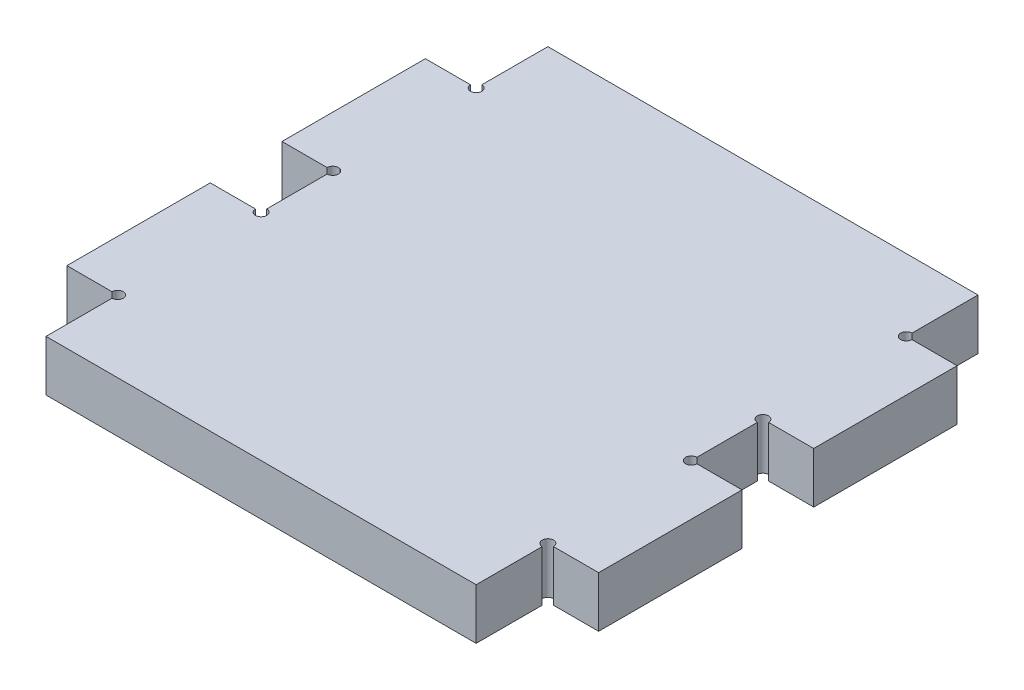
ISO-10303-21;
HEADER;
FILE_DESCRIPTION(('STEP AP214'),'2;1');
FILE_NAME('part.step','',(''),(''),'','','');
FILE_SCHEMA(('AUTOMOTIVE_DESIGN { 1 0 10303 214 1 1 1 1 }'));
ENDSEC;
DATA;
#1=APPLICATION_CONTEXT('core data for automotive mechanical design processes');
#2=APPLICATION_PROTOCOL_DEFINITION('international standard','automotive_design',2000,#1);
#3=PRODUCT_CONTEXT('',#1,'mechanical');
#4=PRODUCT('Part','Part','',(#3));
#5=PRODUCT_RELATED_PRODUCT_CATEGORY('part','',(#4));
#6=PRODUCT_DEFINITION_FORMATION('','',#4);
#7=PRODUCT_DEFINITION_CONTEXT('part definition',#1,'design');
#8=PRODUCT_DEFINITION('design','',#6,#7);
#9=PRODUCT_DEFINITION_SHAPE('','',#8);
#10=(LENGTH_UNIT() NAMED_UNIT(*) SI_UNIT(.MILLI.,.METRE.));
#11=(NAMED_UNIT(*) PLANE_ANGLE_UNIT() SI_UNIT($,.RADIAN.));
#12=(NAMED_UNIT(*) SI_UNIT($,.STERADIAN.) SOLID_ANGLE_UNIT());
#13=UNCERTAINTY_MEASURE_WITH_UNIT(LENGTH_MEASURE(1.E-05),#10,'distance_accuracy_value','');
#14=(GEOMETRIC_REPRESENTATION_CONTEXT(3) GLOBAL_UNCERTAINTY_ASSIGNED_CONTEXT((#13)) GLOBAL_UNIT_ASSIGNED_CONTEXT((#10,
#11,#12)) REPRESENTATION_CONTEXT('',''));
#15=CARTESIAN_POINT('',(0.,0.,0.));
#16=DIRECTION('',(0.,0.,1.));
#17=DIRECTION('',(1.,0.,0.));
#18=AXIS2_PLACEMENT_3D('',#15,#16,#17);
#19=CARTESIAN_POINT('',(0.,4.5,-6.35));
#20=DIRECTION('',(0.,0.,1.));
#21=DIRECTION('',(1.,0.,0.));
#22=AXIS2_PLACEMENT_3D('',#19,#20,#21);
#23=PLANE('',#22);
#24=DIRECTION('',(-1.,0.,0.));
#25=VECTOR('',#24,1.);
#26=CARTESIAN_POINT('',(0.,0.,-6.35));
#27=LINE('',#26,#25);
#28=CARTESIAN_POINT('',(-0.500000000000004,0.,-6.35));
#29=VERTEX_POINT('',#28);
#30=CARTESIAN_POINT('',(-4.5,0.,-6.35));
#31=VERTEX_POINT('',#30);
#32=EDGE_CURVE('E252',#29,#31,#27,.T.);
#33=ORIENTED_EDGE('',*,*,#32,.F.);
#34=DIRECTION('',(0.,-1.,0.));
#35=VECTOR('',#34,1.);
#36=CARTESIAN_POINT('',(-0.500000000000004,4.5,-6.35));
#37=LINE('',#36,#35);
#38=CARTESIAN_POINT('',(-0.500000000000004,4.5,-6.35));
#39=VERTEX_POINT('',#38);
#40=EDGE_CURVE('E11',#39,#29,#37,.T.);
#41=ORIENTED_EDGE('',*,*,#40,.F.);
#42=DIRECTION('',(-1.,0.,0.));
#43=VECTOR('',#42,1.);
#44=CARTESIAN_POINT('',(0.,4.5,-6.35));
#45=LINE('',#44,#43);
#46=CARTESIAN_POINT('',(-4.5,4.5,-6.35));
#47=VERTEX_POINT('',#46);
#48=EDGE_CURVE('E319',#39,#47,#45,.T.);
#49=ORIENTED_EDGE('',*,*,#48,.T.);
#50=DIRECTION('',(0.,-1.,0.));
#51=VECTOR('',#50,1.);
#52=CARTESIAN_POINT('',(-4.5,4.5,-6.35));
#53=LINE('',#52,#51);
#54=EDGE_CURVE('E145',#47,#31,#53,.T.);
#55=ORIENTED_EDGE('',*,*,#54,.T.);
#56=EDGE_LOOP('',(#33,#41,#49,#55));
#57=FACE_BOUND('',#56,.T.);
#58=ADVANCED_FACE('F35',(#57),#23,.T.);
#59=CARTESIAN_POINT('',(0.,4.5,-6.35));
#60=DIRECTION('',(0.,-1.,0.));
#61=DIRECTION('',(0.,0.,-1.));
#62=AXIS2_PLACEMENT_3D('',#59,#60,#61);
#63=CYLINDRICAL_SURFACE('',#62,0.500000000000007);
#64=CARTESIAN_POINT('',(0.,0.,-6.35));
#65=DIRECTION('',(0.,1.,0.));
#66=DIRECTION('',(0.,0.,1.));
#67=AXIS2_PLACEMENT_3D('',#64,#65,#66);
#68=CIRCLE('',#67,0.500000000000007);
#69=CARTESIAN_POINT('',(0.,0.,-5.84999999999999));
#70=VERTEX_POINT('',#69);
#71=EDGE_CURVE('E255',#29,#70,#68,.F.);
#72=ORIENTED_EDGE('',*,*,#71,.T.);
#73=DIRECTION('',(0.,-1.,0.));
#74=VECTOR('',#73,1.);
#75=CARTESIAN_POINT('',(0.,4.5,-5.84999999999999));
#76=LINE('',#75,#74);
#77=CARTESIAN_POINT('',(0.,4.5,-5.84999999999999));
#78=VERTEX_POINT('',#77);
#79=EDGE_CURVE('E43',#78,#70,#76,.T.);
#80=ORIENTED_EDGE('',*,*,#79,.F.);
#81=CARTESIAN_POINT('',(0.,4.5,-6.35));
#82=DIRECTION('',(0.,1.,0.));
#83=DIRECTION('',(0.,0.,1.));
#84=AXIS2_PLACEMENT_3D('',#81,#82,#83);
#85=CIRCLE('',#84,0.500000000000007);
#86=EDGE_CURVE('E455',#39,#78,#85,.F.);
#87=ORIENTED_EDGE('',*,*,#86,.F.);
#88=ORIENTED_EDGE('',*,*,#40,.T.);
#89=EDGE_LOOP('',(#72,#80,#87,#88));
#90=FACE_BOUND('',#89,.T.);
#91=ADVANCED_FACE('F378',(#90),#63,.F.);
#92=CARTESIAN_POINT('',(0.,4.5,0.));
#93=DIRECTION('',(-1.,0.,0.));
#94=DIRECTION('',(0.,0.,1.));
#95=AXIS2_PLACEMENT_3D('',#92,#93,#94);
#96=PLANE('',#95);
#97=DIRECTION('',(0.,0.,-1.));
#98=VECTOR('',#97,1.);
#99=CARTESIAN_POINT('',(0.,0.,0.));
#100=LINE('',#99,#98);
#101=CARTESIAN_POINT('',(0.,0.,0.));
#102=VERTEX_POINT('',#101);
#103=EDGE_CURVE('E258',#102,#70,#100,.T.);
#104=ORIENTED_EDGE('',*,*,#103,.F.);
#105=DIRECTION('',(0.,-1.,0.));
#106=VECTOR('',#105,1.);
#107=CARTESIAN_POINT('',(0.,4.5,0.));
#108=LINE('',#107,#106);
#109=CARTESIAN_POINT('',(0.,4.5,0.));
#110=VERTEX_POINT('',#109);
#111=EDGE_CURVE('E369',#110,#102,#108,.T.);
#112=ORIENTED_EDGE('',*,*,#111,.F.);
#113=DIRECTION('',(0.,0.,-1.));
#114=VECTOR('',#113,1.);
#115=CARTESIAN_POINT('',(0.,4.5,0.));
#116=LINE('',#115,#114);
#117=EDGE_CURVE('E247',#110,#78,#116,.T.);
#118=ORIENTED_EDGE('',*,*,#117,.T.);
#119=ORIENTED_EDGE('',*,*,#79,.T.);
#120=EDGE_LOOP('',(#104,#112,#118,#119));
#121=FACE_BOUND('',#120,.T.);
#122=ADVANCED_FACE('F374',(#121),#96,.T.);
#123=CARTESIAN_POINT('',(0.,4.5,0.));
#124=DIRECTION('',(0.,0.,-1.));
#125=DIRECTION('',(-1.,0.,0.));
#126=AXIS2_PLACEMENT_3D('',#123,#124,#125);
#127=PLANE('',#126);
#128=DIRECTION('',(1.,0.,0.));
#129=VECTOR('',#128,1.);
#130=CARTESIAN_POINT('',(0.,0.,0.));
#131=LINE('',#130,#129);
#132=CARTESIAN_POINT('',(38.1,0.,0.));
#133=VERTEX_POINT('',#132);
#134=EDGE_CURVE('E261',#102,#133,#131,.T.);
#135=ORIENTED_EDGE('',*,*,#134,.T.);
#136=DIRECTION('',(0.,-1.,0.));
#137=VECTOR('',#136,1.);
#138=CARTESIAN_POINT('',(38.1,4.5,0.));
#139=LINE('',#138,#137);
#140=CARTESIAN_POINT('',(38.1,4.5,0.));
#141=VERTEX_POINT('',#140);
#142=EDGE_CURVE('E366',#141,#133,#139,.T.);
#143=ORIENTED_EDGE('',*,*,#142,.F.);
#144=DIRECTION('',(1.,0.,0.));
#145=VECTOR('',#144,1.);
#146=CARTESIAN_POINT('',(0.,4.5,0.));
#147=LINE('',#146,#145);
#148=EDGE_CURVE('E395',#110,#141,#147,.T.);
#149=ORIENTED_EDGE('',*,*,#148,.F.);
#150=ORIENTED_EDGE('',*,*,#111,.T.);
#151=EDGE_LOOP('',(#135,#143,#149,#150));
#152=FACE_BOUND('',#151,.T.);
#153=ADVANCED_FACE('F385',(#152),#127,.F.);
#154=CARTESIAN_POINT('',(38.1,4.5,0.));
#155=DIRECTION('',(-1.,0.,0.));
#156=DIRECTION('',(0.,0.,1.));
#157=AXIS2_PLACEMENT_3D('',#154,#155,#156);
#158=PLANE('',#157);
#159=DIRECTION('',(0.,0.,-1.));
#160=VECTOR('',#159,1.);
#161=CARTESIAN_POINT('',(38.1,0.,0.));
#162=LINE('',#161,#160);
#163=CARTESIAN_POINT('',(38.1,0.,-5.85));
#164=VERTEX_POINT('',#163);
#165=EDGE_CURVE('E265',#133,#164,#162,.T.);
#166=ORIENTED_EDGE('',*,*,#165,.T.);
#167=DIRECTION('',(0.,-1.,0.));
#168=VECTOR('',#167,1.);
#169=CARTESIAN_POINT('',(38.1,4.5,-5.85));
#170=LINE('',#169,#168);
#171=CARTESIAN_POINT('',(38.1,4.5,-5.85));
#172=VERTEX_POINT('',#171);
#173=EDGE_CURVE('E364',#172,#164,#170,.T.);
#174=ORIENTED_EDGE('',*,*,#173,.F.);
#175=DIRECTION('',(0.,0.,-1.));
#176=VECTOR('',#175,1.);
#177=CARTESIAN_POINT('',(38.1,4.5,0.));
#178=LINE('',#177,#176);
#179=EDGE_CURVE('E391',#141,#172,#178,.T.);
#180=ORIENTED_EDGE('',*,*,#179,.F.);
#181=ORIENTED_EDGE('',*,*,#142,.T.);
#182=EDGE_LOOP('',(#166,#174,#180,#181));
#183=FACE_BOUND('',#182,.T.);
#184=ADVANCED_FACE('F389',(#183),#158,.F.);
#185=CARTESIAN_POINT('',(38.1,4.5,-6.35));
#186=DIRECTION('',(0.,-1.,0.));
#187=DIRECTION('',(0.,0.,-1.));
#188=AXIS2_PLACEMENT_3D('',#185,#186,#187);
#189=CYLINDRICAL_SURFACE('',#188,0.500000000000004);
#190=CARTESIAN_POINT('',(38.1,0.,-6.35));
#191=DIRECTION('',(0.,1.,0.));
#192=DIRECTION('',(0.,0.,1.));
#193=AXIS2_PLACEMENT_3D('',#190,#191,#192);
#194=CIRCLE('',#193,0.500000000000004);
#195=CARTESIAN_POINT('',(38.6,0.,-6.35));
#196=VERTEX_POINT('',#195);
#197=EDGE_CURVE('E268',#196,#164,#194,.T.);
#198=ORIENTED_EDGE('',*,*,#197,.F.);
#199=DIRECTION('',(0.,-1.,0.));
#200=VECTOR('',#199,1.);
#201=CARTESIAN_POINT('',(38.6,4.5,-6.35));
#202=LINE('',#201,#200);
#203=CARTESIAN_POINT('',(38.6,4.5,-6.35));
#204=VERTEX_POINT('',#203);
#205=EDGE_CURVE('E362',#204,#196,#202,.T.);
#206=ORIENTED_EDGE('',*,*,#205,.F.);
#207=CARTESIAN_POINT('',(38.1,4.5,-6.35));
#208=DIRECTION('',(0.,1.,0.));
#209=DIRECTION('',(0.,0.,1.));
#210=AXIS2_PLACEMENT_3D('',#207,#208,#209);
#211=CIRCLE('',#210,0.500000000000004);
#212=EDGE_CURVE('E394',#204,#172,#211,.T.);
#213=ORIENTED_EDGE('',*,*,#212,.T.);
#214=ORIENTED_EDGE('',*,*,#173,.T.);
#215=EDGE_LOOP('',(#198,#206,#213,#214));
#216=FACE_BOUND('',#215,.T.);
#217=ADVANCED_FACE('F534',(#216),#189,.F.);
#218=CARTESIAN_POINT('',(0.,4.5,-6.34999999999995));
#219=DIRECTION('',(0.,0.,-1.));
#220=DIRECTION('',(-1.,0.,0.));
#221=AXIS2_PLACEMENT_3D('',#218,#219,#220);
#222=PLANE('',#221);
#223=DIRECTION('',(1.,0.,0.));
#224=VECTOR('',#223,1.);
#225=CARTESIAN_POINT('',(0.,0.,-6.34999999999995));
#226=LINE('',#225,#224);
#227=CARTESIAN_POINT('',(42.6,0.,-6.35000000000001));
#228=VERTEX_POINT('',#227);
#229=EDGE_CURVE('E273',#196,#228,#226,.T.);
#230=ORIENTED_EDGE('',*,*,#229,.T.);
#231=DIRECTION('',(0.,-1.,0.));
#232=VECTOR('',#231,1.);
#233=CARTESIAN_POINT('',(42.6,4.5,-6.35000000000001));
#234=LINE('',#233,#232);
#235=CARTESIAN_POINT('',(42.6,4.5,-6.35000000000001));
#236=VERTEX_POINT('',#235);
#237=EDGE_CURVE('E360',#236,#228,#234,.T.);
#238=ORIENTED_EDGE('',*,*,#237,.F.);
#239=DIRECTION('',(1.,0.,0.));
#240=VECTOR('',#239,1.);
#241=CARTESIAN_POINT('',(0.,4.5,-6.34999999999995));
#242=LINE('',#241,#240);
#243=EDGE_CURVE('E399',#204,#236,#242,.T.);
#244=ORIENTED_EDGE('',*,*,#243,.F.);
#245=ORIENTED_EDGE('',*,*,#205,.T.);
#246=EDGE_LOOP('',(#230,#238,#244,#245));
#247=FACE_BOUND('',#246,.T.);
#248=ADVANCED_FACE('F537',(#247),#222,.F.);
#249=CARTESIAN_POINT('',(42.6,4.5,0.));
#250=DIRECTION('',(1.,0.,0.));
#251=DIRECTION('',(0.,0.,-1.));
#252=AXIS2_PLACEMENT_3D('',#249,#250,#251);
#253=PLANE('',#252);
#254=DIRECTION('',(0.,0.,1.));
#255=VECTOR('',#254,1.);
#256=CARTESIAN_POINT('',(42.6,0.,0.));
#257=LINE('',#256,#255);
#258=CARTESIAN_POINT('',(42.6,0.,-19.05));
#259=VERTEX_POINT('',#258);
#260=EDGE_CURVE('E276',#259,#228,#257,.T.);
#261=ORIENTED_EDGE('',*,*,#260,.F.);
#262=DIRECTION('',(0.,-1.,0.));
#263=VECTOR('',#262,1.);
#264=CARTESIAN_POINT('',(42.6,4.5,-19.05));
#265=LINE('',#264,#263);
#266=CARTESIAN_POINT('',(42.6,4.5,-19.05));
#267=VERTEX_POINT('',#266);
#268=EDGE_CURVE('E358',#267,#259,#265,.T.);
#269=ORIENTED_EDGE('',*,*,#268,.F.);
#270=DIRECTION('',(0.,0.,1.));
#271=VECTOR('',#270,1.);
#272=CARTESIAN_POINT('',(42.6,4.5,0.));
#273=LINE('',#272,#271);
#274=EDGE_CURVE('E418',#267,#236,#273,.T.);
#275=ORIENTED_EDGE('',*,*,#274,.T.);
#276=ORIENTED_EDGE('',*,*,#237,.T.);
#277=EDGE_LOOP('',(#261,#269,#275,#276));
#278=FACE_BOUND('',#277,.T.);
#279=ADVANCED_FACE('F541',(#278),#253,.T.);
#280=CARTESIAN_POINT('',(0.,4.5,-19.05));
#281=DIRECTION('',(0.,0.,-1.));
#282=DIRECTION('',(-1.,0.,0.));
#283=AXIS2_PLACEMENT_3D('',#280,#281,#282);
#284=PLANE('',#283);
#285=DIRECTION('',(1.,0.,0.));
#286=VECTOR('',#285,1.);
#287=CARTESIAN_POINT('',(0.,0.,-19.05));
#288=LINE('',#287,#286);
#289=CARTESIAN_POINT('',(38.6,0.,-19.05));
#290=VERTEX_POINT('',#289);
#291=EDGE_CURVE('E279',#290,#259,#288,.T.);
#292=ORIENTED_EDGE('',*,*,#291,.F.);
#293=DIRECTION('',(0.,-1.,0.));
#294=VECTOR('',#293,1.);
#295=CARTESIAN_POINT('',(38.6,4.5,-19.05));
#296=LINE('',#295,#294);
#297=CARTESIAN_POINT('',(38.6,4.5,-19.05));
#298=VERTEX_POINT('',#297);
#299=EDGE_CURVE('E356',#298,#290,#296,.T.);
#300=ORIENTED_EDGE('',*,*,#299,.F.);
#301=DIRECTION('',(1.,0.,0.));
#302=VECTOR('',#301,1.);
#303=CARTESIAN_POINT('',(0.,4.5,-19.05));
#304=LINE('',#303,#302);
#305=EDGE_CURVE('E412',#298,#267,#304,.T.);
#306=ORIENTED_EDGE('',*,*,#305,.T.);
#307=ORIENTED_EDGE('',*,*,#268,.T.);
#308=EDGE_LOOP('',(#292,#300,#306,#307));
#309=FACE_BOUND('',#308,.T.);
#310=ADVANCED_FACE('F545',(#309),#284,.T.);
#311=CARTESIAN_POINT('',(38.1,4.5,-19.05));
#312=DIRECTION('',(0.,-1.,0.));
#313=DIRECTION('',(0.,0.,-1.));
#314=AXIS2_PLACEMENT_3D('',#311,#312,#313);
#315=CYLINDRICAL_SURFACE('',#314,0.499999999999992);
#316=CARTESIAN_POINT('',(38.1,0.,-19.05));
#317=DIRECTION('',(0.,1.,0.));
#318=DIRECTION('',(0.,0.,1.));
#319=AXIS2_PLACEMENT_3D('',#316,#317,#318);
#320=CIRCLE('',#319,0.499999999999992);
#321=CARTESIAN_POINT('',(38.1,0.,-19.55));
#322=VERTEX_POINT('',#321);
#323=EDGE_CURVE('E282',#290,#322,#320,.F.);
#324=ORIENTED_EDGE('',*,*,#323,.T.);
#325=DIRECTION('',(0.,-1.,0.));
#326=VECTOR('',#325,1.);
#327=CARTESIAN_POINT('',(38.1,4.5,-19.55));
#328=LINE('',#327,#326);
#329=CARTESIAN_POINT('',(38.1,4.5,-19.55));
#330=VERTEX_POINT('',#329);
#331=EDGE_CURVE('E353',#330,#322,#328,.T.);
#332=ORIENTED_EDGE('',*,*,#331,.F.);
#333=CARTESIAN_POINT('',(38.1,4.5,-19.05));
#334=DIRECTION('',(0.,1.,0.));
#335=DIRECTION('',(0.,0.,1.));
#336=AXIS2_PLACEMENT_3D('',#333,#334,#335);
#337=CIRCLE('',#336,0.499999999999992);
#338=EDGE_CURVE('E405',#298,#330,#337,.F.);
#339=ORIENTED_EDGE('',*,*,#338,.F.);
#340=ORIENTED_EDGE('',*,*,#299,.T.);
#341=EDGE_LOOP('',(#324,#332,#339,#340));
#342=FACE_BOUND('',#341,.T.);
#343=ADVANCED_FACE('F549',(#342),#315,.F.);
#344=CARTESIAN_POINT('',(38.1,0.,-24.9));
#345=VERTEX_POINT('',#344);
#346=EDGE_CURVE('E270',#322,#345,#162,.T.);
#347=ORIENTED_EDGE('',*,*,#346,.T.);
#348=DIRECTION('',(0.,-1.,0.));
#349=VECTOR('',#348,1.);
#350=CARTESIAN_POINT('',(38.1,4.5,-24.9));
#351=LINE('',#350,#349);
#352=CARTESIAN_POINT('',(38.1,4.5,-24.9));
#353=VERTEX_POINT('',#352);
#354=EDGE_CURVE('E351',#353,#345,#351,.T.);
#355=ORIENTED_EDGE('',*,*,#354,.F.);
#356=EDGE_CURVE('E398',#330,#353,#178,.T.);
#357=ORIENTED_EDGE('',*,*,#356,.F.);
#358=ORIENTED_EDGE('',*,*,#331,.T.);
#359=EDGE_LOOP('',(#347,#355,#357,#358));
#360=FACE_BOUND('',#359,.T.);
#361=ADVANCED_FACE('F493',(#360),#158,.F.);
#362=CARTESIAN_POINT('',(38.1,4.5,-25.4));
#363=DIRECTION('',(0.,-1.,0.));
#364=DIRECTION('',(0.,0.,-1.));
#365=AXIS2_PLACEMENT_3D('',#362,#363,#364);
#366=CYLINDRICAL_SURFACE('',#365,0.499999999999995);
#367=CARTESIAN_POINT('',(38.1,0.,-25.4));
#368=DIRECTION('',(0.,1.,0.));
#369=DIRECTION('',(0.,0.,1.));
#370=AXIS2_PLACEMENT_3D('',#367,#368,#369);
#371=CIRCLE('',#370,0.499999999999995);
#372=CARTESIAN_POINT('',(38.6,0.,-25.4));
#373=VERTEX_POINT('',#372);
#374=EDGE_CURVE('E284',#373,#345,#371,.T.);
#375=ORIENTED_EDGE('',*,*,#374,.F.);
#376=DIRECTION('',(0.,-1.,0.));
#377=VECTOR('',#376,1.);
#378=CARTESIAN_POINT('',(38.6,4.5,-25.4));
#379=LINE('',#378,#377);
#380=CARTESIAN_POINT('',(38.6,4.5,-25.4));
#381=VERTEX_POINT('',#380);
#382=EDGE_CURVE('E349',#381,#373,#379,.T.);
#383=ORIENTED_EDGE('',*,*,#382,.F.);
#384=CARTESIAN_POINT('',(38.1,4.5,-25.4));
#385=DIRECTION('',(0.,1.,0.));
#386=DIRECTION('',(0.,0.,1.));
#387=AXIS2_PLACEMENT_3D('',#384,#385,#386);
#388=CIRCLE('',#387,0.499999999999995);
#389=EDGE_CURVE('E404',#381,#353,#388,.T.);
#390=ORIENTED_EDGE('',*,*,#389,.T.);
#391=ORIENTED_EDGE('',*,*,#354,.T.);
#392=EDGE_LOOP('',(#375,#383,#390,#391));
#393=FACE_BOUND('',#392,.T.);
#394=ADVANCED_FACE('F499',(#393),#366,.F.);
#395=CARTESIAN_POINT('',(0.,4.5,-25.3999999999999));
#396=DIRECTION('',(0.,0.,-1.));
#397=DIRECTION('',(-1.,0.,0.));
#398=AXIS2_PLACEMENT_3D('',#395,#396,#397);
#399=PLANE('',#398);
#400=DIRECTION('',(1.,0.,0.));
#401=VECTOR('',#400,1.);
#402=CARTESIAN_POINT('',(0.,0.,-25.3999999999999));
#403=LINE('',#402,#401);
#404=CARTESIAN_POINT('',(42.6,0.,-25.4));
#405=VERTEX_POINT('',#404);
#406=EDGE_CURVE('E287',#373,#405,#403,.T.);
#407=ORIENTED_EDGE('',*,*,#406,.T.);
#408=DIRECTION('',(0.,-1.,0.));
#409=VECTOR('',#408,1.);
#410=CARTESIAN_POINT('',(42.6,4.5,-25.4));
#411=LINE('',#410,#409);
#412=CARTESIAN_POINT('',(42.6,4.5,-25.4));
#413=VERTEX_POINT('',#412);
#414=EDGE_CURVE('E346',#413,#405,#411,.T.);
#415=ORIENTED_EDGE('',*,*,#414,.F.);
#416=DIRECTION('',(1.,0.,0.));
#417=VECTOR('',#416,1.);
#418=CARTESIAN_POINT('',(0.,4.5,-25.3999999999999));
#419=LINE('',#418,#417);
#420=EDGE_CURVE('E410',#381,#413,#419,.T.);
#421=ORIENTED_EDGE('',*,*,#420,.F.);
#422=ORIENTED_EDGE('',*,*,#382,.T.);
#423=EDGE_LOOP('',(#407,#415,#421,#422));
#424=FACE_BOUND('',#423,.T.);
#425=ADVANCED_FACE('F506',(#424),#399,.F.);
#426=CARTESIAN_POINT('',(42.6,4.5,0.));
#427=DIRECTION('',(-1.,0.,0.));
#428=DIRECTION('',(0.,0.,1.));
#429=AXIS2_PLACEMENT_3D('',#426,#427,#428);
#430=PLANE('',#429);
#431=DIRECTION('',(0.,0.,-1.));
#432=VECTOR('',#431,1.);
#433=CARTESIAN_POINT('',(42.6,0.,0.));
#434=LINE('',#433,#432);
#435=CARTESIAN_POINT('',(42.6,0.,-38.1));
#436=VERTEX_POINT('',#435);
#437=EDGE_CURVE('E289',#405,#436,#434,.T.);
#438=ORIENTED_EDGE('',*,*,#437,.T.);
#439=DIRECTION('',(0.,-1.,0.));
#440=VECTOR('',#439,1.);
#441=CARTESIAN_POINT('',(42.6,4.5,-38.1));
#442=LINE('',#441,#440);
#443=CARTESIAN_POINT('',(42.6,4.5,-38.1));
#444=VERTEX_POINT('',#443);
#445=EDGE_CURVE('E344',#444,#436,#442,.T.);
#446=ORIENTED_EDGE('',*,*,#445,.F.);
#447=DIRECTION('',(0.,0.,-1.));
#448=VECTOR('',#447,1.);
#449=CARTESIAN_POINT('',(42.6,4.5,0.));
#450=LINE('',#449,#448);
#451=EDGE_CURVE('E423',#413,#444,#450,.T.);
#452=ORIENTED_EDGE('',*,*,#451,.F.);
#453=ORIENTED_EDGE('',*,*,#414,.T.);
#454=EDGE_LOOP('',(#438,#446,#452,#453));
#455=FACE_BOUND('',#454,.T.);
#456=ADVANCED_FACE('F508',(#455),#430,.F.);
#457=CARTESIAN_POINT('',(-1.17498603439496E-13,4.5,-38.0999999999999));
#458=DIRECTION('',(0.,0.,-1.));
#459=DIRECTION('',(-1.,0.,0.));
#460=AXIS2_PLACEMENT_3D('',#457,#458,#459);
#461=PLANE('',#460);
#462=DIRECTION('',(1.,0.,0.));
#463=VECTOR('',#462,1.);
#464=CARTESIAN_POINT('',(-1.17498603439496E-13,0.,-38.0999999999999));
#465=LINE('',#464,#463);
#466=CARTESIAN_POINT('',(38.6,0.,-38.1));
#467=VERTEX_POINT('',#466);
#468=EDGE_CURVE('E292',#467,#436,#465,.T.);
#469=ORIENTED_EDGE('',*,*,#468,.F.);
#470=DIRECTION('',(0.,-1.,0.));
#471=VECTOR('',#470,1.);
#472=CARTESIAN_POINT('',(38.6,4.5,-38.1));
#473=LINE('',#472,#471);
#474=CARTESIAN_POINT('',(38.6,4.5,-38.1));
#475=VERTEX_POINT('',#474);
#476=EDGE_CURVE('E342',#475,#467,#473,.T.);
#477=ORIENTED_EDGE('',*,*,#476,.F.);
#478=DIRECTION('',(1.,0.,0.));
#479=VECTOR('',#478,1.);
#480=CARTESIAN_POINT('',(-1.17498603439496E-13,4.5,-38.0999999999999));
#481=LINE('',#480,#479);
#482=EDGE_CURVE('E425',#475,#444,#481,.T.);
#483=ORIENTED_EDGE('',*,*,#482,.T.);
#484=ORIENTED_EDGE('',*,*,#445,.T.);
#485=EDGE_LOOP('',(#469,#477,#483,#484));
#486=FACE_BOUND('',#485,.T.);
#487=ADVANCED_FACE('F511',(#486),#461,.T.);
#488=CARTESIAN_POINT('',(38.1,4.5,-38.1));
#489=DIRECTION('',(0.,-1.,0.));
#490=DIRECTION('',(0.,0.,-1.));
#491=AXIS2_PLACEMENT_3D('',#488,#489,#490);
#492=CYLINDRICAL_SURFACE('',#491,0.500000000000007);
#493=CARTESIAN_POINT('',(38.1,0.,-38.1));
#494=DIRECTION('',(0.,1.,0.));
#495=DIRECTION('',(0.,0.,1.));
#496=AXIS2_PLACEMENT_3D('',#493,#494,#495);
#497=CIRCLE('',#496,0.500000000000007);
#498=CARTESIAN_POINT('',(38.1,0.,-38.6));
#499=VERTEX_POINT('',#498);
#500=EDGE_CURVE('E295',#467,#499,#497,.F.);
#501=ORIENTED_EDGE('',*,*,#500,.T.);
#502=DIRECTION('',(0.,-1.,0.));
#503=VECTOR('',#502,1.);
#504=CARTESIAN_POINT('',(38.1,4.5,-38.6));
#505=LINE('',#504,#503);
#506=CARTESIAN_POINT('',(38.1,4.5,-38.6));
#507=VERTEX_POINT('',#506);
#508=EDGE_CURVE('E339',#507,#499,#505,.T.);
#509=ORIENTED_EDGE('',*,*,#508,.F.);
#510=CARTESIAN_POINT('',(38.1,4.5,-38.1));
#511=DIRECTION('',(0.,1.,0.));
#512=DIRECTION('',(0.,0.,1.));
#513=AXIS2_PLACEMENT_3D('',#510,#511,#512);
#514=CIRCLE('',#513,0.500000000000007);
#515=EDGE_CURVE('E403',#475,#507,#514,.F.);
#516=ORIENTED_EDGE('',*,*,#515,.F.);
#517=ORIENTED_EDGE('',*,*,#476,.T.);
#518=EDGE_LOOP('',(#501,#509,#516,#517));
#519=FACE_BOUND('',#518,.T.);
#520=ADVANCED_FACE('F514',(#519),#492,.F.);
#521=CARTESIAN_POINT('',(38.1,0.,-44.45));
#522=VERTEX_POINT('',#521);
#523=EDGE_CURVE('E269',#499,#522,#162,.T.);
#524=ORIENTED_EDGE('',*,*,#523,.T.);
#525=DIRECTION('',(0.,-1.,0.));
#526=VECTOR('',#525,1.);
#527=CARTESIAN_POINT('',(38.1,4.5,-44.45));
#528=LINE('',#527,#526);
#529=CARTESIAN_POINT('',(38.1,4.5,-44.45));
#530=VERTEX_POINT('',#529);
#531=EDGE_CURVE('E337',#530,#522,#528,.T.);
#532=ORIENTED_EDGE('',*,*,#531,.F.);
#533=EDGE_CURVE('E397',#507,#530,#178,.T.);
#534=ORIENTED_EDGE('',*,*,#533,.F.);
#535=ORIENTED_EDGE('',*,*,#508,.T.);
#536=EDGE_LOOP('',(#524,#532,#534,#535));
#537=FACE_BOUND('',#536,.T.);
#538=ADVANCED_FACE('F488',(#537),#158,.F.);
#539=CARTESIAN_POINT('',(0.,4.5,-44.45));
#540=DIRECTION('',(0.,0.,-1.));
#541=DIRECTION('',(-1.,0.,0.));
#542=AXIS2_PLACEMENT_3D('',#539,#540,#541);
#543=PLANE('',#542);
#544=DIRECTION('',(1.,0.,0.));
#545=VECTOR('',#544,1.);
#546=CARTESIAN_POINT('',(0.,0.,-44.45));
#547=LINE('',#546,#545);
#548=CARTESIAN_POINT('',(0.,0.,-44.45));
#549=VERTEX_POINT('',#548);
#550=EDGE_CURVE('E297',#549,#522,#547,.T.);
#551=ORIENTED_EDGE('',*,*,#550,.F.);
#552=DIRECTION('',(0.,-1.,0.));
#553=VECTOR('',#552,1.);
#554=CARTESIAN_POINT('',(0.,4.5,-44.45));
#555=LINE('',#554,#553);
#556=CARTESIAN_POINT('',(0.,4.5,-44.45));
#557=VERTEX_POINT('',#556);
#558=EDGE_CURVE('E335',#557,#549,#555,.T.);
#559=ORIENTED_EDGE('',*,*,#558,.F.);
#560=DIRECTION('',(1.,0.,0.));
#561=VECTOR('',#560,1.);
#562=CARTESIAN_POINT('',(0.,4.5,-44.45));
#563=LINE('',#562,#561);
#564=EDGE_CURVE('E402',#557,#530,#563,.T.);
#565=ORIENTED_EDGE('',*,*,#564,.T.);
#566=ORIENTED_EDGE('',*,*,#531,.T.);
#567=EDGE_LOOP('',(#551,#559,#565,#566));
#568=FACE_BOUND('',#567,.T.);
#569=ADVANCED_FACE('F484',(#568),#543,.T.);
#570=CARTESIAN_POINT('',(0.,0.,-38.6));
#571=VERTEX_POINT('',#570);
#572=EDGE_CURVE('E263',#571,#549,#100,.T.);
#573=ORIENTED_EDGE('',*,*,#572,.F.);
#574=DIRECTION('',(0.,-1.,0.));
#575=VECTOR('',#574,1.);
#576=CARTESIAN_POINT('',(0.,4.5,-38.6));
#577=LINE('',#576,#575);
#578=CARTESIAN_POINT('',(0.,4.5,-38.6));
#579=VERTEX_POINT('',#578);
#580=EDGE_CURVE('E333',#579,#571,#577,.T.);
#581=ORIENTED_EDGE('',*,*,#580,.F.);
#582=EDGE_CURVE('E246',#579,#557,#116,.T.);
#583=ORIENTED_EDGE('',*,*,#582,.T.);
#584=ORIENTED_EDGE('',*,*,#558,.T.);
#585=EDGE_LOOP('',(#573,#581,#583,#584));
#586=FACE_BOUND('',#585,.T.);
#587=ADVANCED_FACE('F462',(#586),#96,.T.);
#588=CARTESIAN_POINT('',(0.,4.5,-38.1));
#589=DIRECTION('',(0.,-1.,0.));
#590=DIRECTION('',(0.,0.,-1.));
#591=AXIS2_PLACEMENT_3D('',#588,#589,#590);
#592=CYLINDRICAL_SURFACE('',#591,0.500000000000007);
#593=CARTESIAN_POINT('',(0.,0.,-38.1));
#594=DIRECTION('',(0.,1.,0.));
#595=DIRECTION('',(0.,0.,1.));
#596=AXIS2_PLACEMENT_3D('',#593,#594,#595);
#597=CIRCLE('',#596,0.500000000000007);
#598=CARTESIAN_POINT('',(-0.500000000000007,0.,-38.1));
#599=VERTEX_POINT('',#598);
#600=EDGE_CURVE('E300',#599,#571,#597,.T.);
#601=ORIENTED_EDGE('',*,*,#600,.F.);
#602=DIRECTION('',(0.,-1.,0.));
#603=VECTOR('',#602,1.);
#604=CARTESIAN_POINT('',(-0.500000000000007,4.5,-38.1));
#605=LINE('',#604,#603);
#606=CARTESIAN_POINT('',(-0.500000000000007,4.5,-38.1));
#607=VERTEX_POINT('',#606);
#608=EDGE_CURVE('E331',#607,#599,#605,.T.);
#609=ORIENTED_EDGE('',*,*,#608,.F.);
#610=CARTESIAN_POINT('',(0.,4.5,-38.1));
#611=DIRECTION('',(0.,1.,0.));
#612=DIRECTION('',(0.,0.,1.));
#613=AXIS2_PLACEMENT_3D('',#610,#611,#612);
#614=CIRCLE('',#613,0.500000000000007);
#615=EDGE_CURVE('E431',#607,#579,#614,.T.);
#616=ORIENTED_EDGE('',*,*,#615,.T.);
#617=ORIENTED_EDGE('',*,*,#580,.T.);
#618=EDGE_LOOP('',(#601,#609,#616,#617));
#619=FACE_BOUND('',#618,.T.);
#620=ADVANCED_FACE('F468',(#619),#592,.F.);
#621=CARTESIAN_POINT('',(2.34997206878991E-13,4.5,-38.1));
#622=DIRECTION('',(0.,0.,1.));
#623=DIRECTION('',(1.,0.,0.));
#624=AXIS2_PLACEMENT_3D('',#621,#622,#623);
#625=PLANE('',#624);
#626=DIRECTION('',(-1.,0.,0.));
#627=VECTOR('',#626,1.);
#628=CARTESIAN_POINT('',(2.34997206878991E-13,0.,-38.1));
#629=LINE('',#628,#627);
#630=CARTESIAN_POINT('',(-4.5,0.,-38.1));
#631=VERTEX_POINT('',#630);
#632=EDGE_CURVE('E303',#599,#631,#629,.T.);
#633=ORIENTED_EDGE('',*,*,#632,.T.);
#634=DIRECTION('',(0.,-1.,0.));
#635=VECTOR('',#634,1.);
#636=CARTESIAN_POINT('',(-4.5,4.5,-38.1));
#637=LINE('',#636,#635);
#638=CARTESIAN_POINT('',(-4.5,4.5,-38.1));
#639=VERTEX_POINT('',#638);
#640=EDGE_CURVE('E329',#639,#631,#637,.T.);
#641=ORIENTED_EDGE('',*,*,#640,.F.);
#642=DIRECTION('',(-1.,0.,0.));
#643=VECTOR('',#642,1.);
#644=CARTESIAN_POINT('',(2.34997206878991E-13,4.5,-38.1));
#645=LINE('',#644,#643);
#646=EDGE_CURVE('E434',#607,#639,#645,.T.);
#647=ORIENTED_EDGE('',*,*,#646,.F.);
#648=ORIENTED_EDGE('',*,*,#608,.T.);
#649=EDGE_LOOP('',(#633,#641,#647,#648));
#650=FACE_BOUND('',#649,.T.);
#651=ADVANCED_FACE('F473',(#650),#625,.F.);
#652=CARTESIAN_POINT('',(-4.5,4.5,0.));
#653=DIRECTION('',(-1.,0.,0.));
#654=DIRECTION('',(0.,0.,1.));
#655=AXIS2_PLACEMENT_3D('',#652,#653,#654);
#656=PLANE('',#655);
#657=DIRECTION('',(0.,0.,-1.));
#658=VECTOR('',#657,1.);
#659=CARTESIAN_POINT('',(-4.5,0.,0.));
#660=LINE('',#659,#658);
#661=CARTESIAN_POINT('',(-4.5,0.,-25.4));
#662=VERTEX_POINT('',#661);
#663=EDGE_CURVE('E306',#662,#631,#660,.T.);
#664=ORIENTED_EDGE('',*,*,#663,.F.);
#665=DIRECTION('',(0.,-1.,0.));
#666=VECTOR('',#665,1.);
#667=CARTESIAN_POINT('',(-4.5,4.5,-25.4));
#668=LINE('',#667,#666);
#669=CARTESIAN_POINT('',(-4.5,4.5,-25.4));
#670=VERTEX_POINT('',#669);
#671=EDGE_CURVE('E327',#670,#662,#668,.T.);
#672=ORIENTED_EDGE('',*,*,#671,.F.);
#673=DIRECTION('',(0.,0.,-1.));
#674=VECTOR('',#673,1.);
#675=CARTESIAN_POINT('',(-4.5,4.5,0.));
#676=LINE('',#675,#674);
#677=EDGE_CURVE('E436',#670,#639,#676,.T.);
#678=ORIENTED_EDGE('',*,*,#677,.T.);
#679=ORIENTED_EDGE('',*,*,#640,.T.);
#680=EDGE_LOOP('',(#664,#672,#678,#679));
#681=FACE_BOUND('',#680,.T.);
#682=ADVANCED_FACE('F476',(#681),#656,.T.);
#683=CARTESIAN_POINT('',(1.37081704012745E-13,4.5,-25.4));
#684=DIRECTION('',(0.,0.,1.));
#685=DIRECTION('',(1.,0.,0.));
#686=AXIS2_PLACEMENT_3D('',#683,#684,#685);
#687=PLANE('',#686);
#688=DIRECTION('',(-1.,0.,0.));
#689=VECTOR('',#688,1.);
#690=CARTESIAN_POINT('',(1.37081704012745E-13,0.,-25.4));
#691=LINE('',#690,#689);
#692=CARTESIAN_POINT('',(-0.499999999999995,0.,-25.4));
#693=VERTEX_POINT('',#692);
#694=EDGE_CURVE('E309',#693,#662,#691,.T.);
#695=ORIENTED_EDGE('',*,*,#694,.F.);
#696=DIRECTION('',(0.,-1.,0.));
#697=VECTOR('',#696,1.);
#698=CARTESIAN_POINT('',(-0.499999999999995,4.5,-25.4));
#699=LINE('',#698,#697);
#700=CARTESIAN_POINT('',(-0.499999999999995,4.5,-25.4));
#701=VERTEX_POINT('',#700);
#702=EDGE_CURVE('E325',#701,#693,#699,.T.);
#703=ORIENTED_EDGE('',*,*,#702,.F.);
#704=DIRECTION('',(-1.,0.,0.));
#705=VECTOR('',#704,1.);
#706=CARTESIAN_POINT('',(1.37081704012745E-13,4.5,-25.4));
#707=LINE('',#706,#705);
#708=EDGE_CURVE('E438',#701,#670,#707,.T.);
#709=ORIENTED_EDGE('',*,*,#708,.T.);
#710=ORIENTED_EDGE('',*,*,#671,.T.);
#711=EDGE_LOOP('',(#695,#703,#709,#710));
#712=FACE_BOUND('',#711,.T.);
#713=ADVANCED_FACE('F478',(#712),#687,.T.);
#714=CARTESIAN_POINT('',(0.,4.5,-25.4));
#715=DIRECTION('',(0.,-1.,0.));
#716=DIRECTION('',(0.,0.,-1.));
#717=AXIS2_PLACEMENT_3D('',#714,#715,#716);
#718=CYLINDRICAL_SURFACE('',#717,0.499999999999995);
#719=CARTESIAN_POINT('',(0.,0.,-25.4));
#720=DIRECTION('',(0.,1.,0.));
#721=DIRECTION('',(0.,0.,1.));
#722=AXIS2_PLACEMENT_3D('',#719,#720,#721);
#723=CIRCLE('',#722,0.499999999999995);
#724=CARTESIAN_POINT('',(0.,0.,-24.9));
#725=VERTEX_POINT('',#724);
#726=EDGE_CURVE('E312',#693,#725,#723,.F.);
#727=ORIENTED_EDGE('',*,*,#726,.T.);
#728=DIRECTION('',(0.,-1.,0.));
#729=VECTOR('',#728,1.);
#730=CARTESIAN_POINT('',(0.,4.5,-24.9));
#731=LINE('',#730,#729);
#732=CARTESIAN_POINT('',(0.,4.5,-24.9));
#733=VERTEX_POINT('',#732);
#734=EDGE_CURVE('E323',#733,#725,#731,.T.);
#735=ORIENTED_EDGE('',*,*,#734,.F.);
#736=CARTESIAN_POINT('',(0.,4.5,-25.4));
#737=DIRECTION('',(0.,1.,0.));
#738=DIRECTION('',(0.,0.,1.));
#739=AXIS2_PLACEMENT_3D('',#736,#737,#738);
#740=CIRCLE('',#739,0.499999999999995);
#741=EDGE_CURVE('E244',#701,#733,#740,.F.);
#742=ORIENTED_EDGE('',*,*,#741,.F.);
#743=ORIENTED_EDGE('',*,*,#702,.T.);
#744=EDGE_LOOP('',(#727,#735,#742,#743));
#745=FACE_BOUND('',#744,.T.);
#746=ADVANCED_FACE('F446',(#745),#718,.F.);
#747=CARTESIAN_POINT('',(0.,0.,-19.55));
#748=VERTEX_POINT('',#747);
#749=EDGE_CURVE('E262',#748,#725,#100,.T.);
#750=ORIENTED_EDGE('',*,*,#749,.F.);
#751=DIRECTION('',(0.,-1.,0.));
#752=VECTOR('',#751,1.);
#753=CARTESIAN_POINT('',(0.,4.5,-19.55));
#754=LINE('',#753,#752);
#755=CARTESIAN_POINT('',(0.,4.5,-19.55));
#756=VERTEX_POINT('',#755);
#757=EDGE_CURVE('E233',#756,#748,#754,.T.);
#758=ORIENTED_EDGE('',*,*,#757,.F.);
#759=EDGE_CURVE('E242',#756,#733,#116,.T.);
#760=ORIENTED_EDGE('',*,*,#759,.T.);
#761=ORIENTED_EDGE('',*,*,#734,.T.);
#762=EDGE_LOOP('',(#750,#758,#760,#761));
#763=FACE_BOUND('',#762,.T.);
#764=ADVANCED_FACE('F451',(#763),#96,.T.);
#765=CARTESIAN_POINT('',(0.,4.5,-19.05));
#766=DIRECTION('',(0.,-1.,0.));
#767=DIRECTION('',(0.,0.,-1.));
#768=AXIS2_PLACEMENT_3D('',#765,#766,#767);
#769=CYLINDRICAL_SURFACE('',#768,0.499999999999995);
#770=CARTESIAN_POINT('',(0.,0.,-19.05));
#771=DIRECTION('',(0.,1.,0.));
#772=DIRECTION('',(0.,0.,1.));
#773=AXIS2_PLACEMENT_3D('',#770,#771,#772);
#774=CIRCLE('',#773,0.499999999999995);
#775=CARTESIAN_POINT('',(-0.499999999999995,0.,-19.05));
#776=VERTEX_POINT('',#775);
#777=EDGE_CURVE('E232',#776,#748,#774,.T.);
#778=ORIENTED_EDGE('',*,*,#777,.F.);
#779=DIRECTION('',(0.,-1.,0.));
#780=VECTOR('',#779,1.);
#781=CARTESIAN_POINT('',(-0.499999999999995,4.5,-19.05));
#782=LINE('',#781,#780);
#783=CARTESIAN_POINT('',(-0.499999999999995,4.5,-19.05));
#784=VERTEX_POINT('',#783);
#785=EDGE_CURVE('E226',#784,#776,#782,.T.);
#786=ORIENTED_EDGE('',*,*,#785,.F.);
#787=CARTESIAN_POINT('',(0.,4.5,-19.05));
#788=DIRECTION('',(0.,1.,0.));
#789=DIRECTION('',(0.,0.,1.));
#790=AXIS2_PLACEMENT_3D('',#787,#788,#789);
#791=CIRCLE('',#790,0.499999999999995);
#792=EDGE_CURVE('E230',#784,#756,#791,.T.);
#793=ORIENTED_EDGE('',*,*,#792,.T.);
#794=ORIENTED_EDGE('',*,*,#757,.T.);
#795=EDGE_LOOP('',(#778,#786,#793,#794));
#796=FACE_BOUND('',#795,.T.);
#797=ADVANCED_FACE('F228',(#796),#769,.F.);
#798=CARTESIAN_POINT('',(0.,4.5,-19.05));
#799=DIRECTION('',(0.,0.,1.));
#800=DIRECTION('',(1.,0.,0.));
#801=AXIS2_PLACEMENT_3D('',#798,#799,#800);
#802=PLANE('',#801);
#803=DIRECTION('',(-1.,0.,0.));
#804=VECTOR('',#803,1.);
#805=CARTESIAN_POINT('',(0.,0.,-19.05));
#806=LINE('',#805,#804);
#807=CARTESIAN_POINT('',(-4.5,0.,-19.05));
#808=VERTEX_POINT('',#807);
#809=EDGE_CURVE('E138',#776,#808,#806,.T.);
#810=ORIENTED_EDGE('',*,*,#809,.T.);
#811=DIRECTION('',(0.,-1.,0.));
#812=VECTOR('',#811,1.);
#813=CARTESIAN_POINT('',(-4.5,4.5,-19.05));
#814=LINE('',#813,#812);
#815=CARTESIAN_POINT('',(-4.5,4.5,-19.05));
#816=VERTEX_POINT('',#815);
#817=EDGE_CURVE('E234',#816,#808,#814,.T.);
#818=ORIENTED_EDGE('',*,*,#817,.F.);
#819=DIRECTION('',(-1.,0.,0.));
#820=VECTOR('',#819,1.);
#821=CARTESIAN_POINT('',(0.,4.5,-19.05));
#822=LINE('',#821,#820);
#823=EDGE_CURVE('E236',#784,#816,#822,.T.);
#824=ORIENTED_EDGE('',*,*,#823,.F.);
#825=ORIENTED_EDGE('',*,*,#785,.T.);
#826=EDGE_LOOP('',(#810,#818,#824,#825));
#827=FACE_BOUND('',#826,.T.);
#828=ADVANCED_FACE('F237',(#827),#802,.F.);
#829=CARTESIAN_POINT('',(-4.5,4.5,0.));
#830=DIRECTION('',(1.,0.,0.));
#831=DIRECTION('',(0.,0.,-1.));
#832=AXIS2_PLACEMENT_3D('',#829,#830,#831);
#833=PLANE('',#832);
#834=DIRECTION('',(0.,0.,1.));
#835=VECTOR('',#834,1.);
#836=CARTESIAN_POINT('',(-4.5,0.,0.));
#837=LINE('',#836,#835);
#838=EDGE_CURVE('E317',#808,#31,#837,.T.);
#839=ORIENTED_EDGE('',*,*,#838,.T.);
#840=ORIENTED_EDGE('',*,*,#54,.F.);
#841=DIRECTION('',(0.,0.,1.));
#842=VECTOR('',#841,1.);
#843=CARTESIAN_POINT('',(-4.5,4.5,0.));
#844=LINE('',#843,#842);
#845=EDGE_CURVE('E51',#816,#47,#844,.T.);
#846=ORIENTED_EDGE('',*,*,#845,.F.);
#847=ORIENTED_EDGE('',*,*,#817,.T.);
#848=EDGE_LOOP('',(#839,#840,#846,#847));
#849=FACE_BOUND('',#848,.T.);
#850=ADVANCED_FACE('F454',(#849),#833,.F.);
#851=CARTESIAN_POINT('',(0.,4.5,0.));
#852=DIRECTION('',(0.,1.,0.));
#853=DIRECTION('',(0.,0.,1.));
#854=AXIS2_PLACEMENT_3D('',#851,#852,#853);
#855=PLANE('',#854);
#856=ORIENTED_EDGE('',*,*,#48,.F.);
#857=ORIENTED_EDGE('',*,*,#86,.T.);
#858=ORIENTED_EDGE('',*,*,#117,.F.);
#859=ORIENTED_EDGE('',*,*,#148,.T.);
#860=ORIENTED_EDGE('',*,*,#179,.T.);
#861=ORIENTED_EDGE('',*,*,#212,.F.);
#862=ORIENTED_EDGE('',*,*,#243,.T.);
#863=ORIENTED_EDGE('',*,*,#274,.F.);
#864=ORIENTED_EDGE('',*,*,#305,.F.);
#865=ORIENTED_EDGE('',*,*,#338,.T.);
#866=ORIENTED_EDGE('',*,*,#356,.T.);
#867=ORIENTED_EDGE('',*,*,#389,.F.);
#868=ORIENTED_EDGE('',*,*,#420,.T.);
#869=ORIENTED_EDGE('',*,*,#451,.T.);
#870=ORIENTED_EDGE('',*,*,#482,.F.);
#871=ORIENTED_EDGE('',*,*,#515,.T.);
#872=ORIENTED_EDGE('',*,*,#533,.T.);
#873=ORIENTED_EDGE('',*,*,#564,.F.);
#874=ORIENTED_EDGE('',*,*,#582,.F.);
#875=ORIENTED_EDGE('',*,*,#615,.F.);
#876=ORIENTED_EDGE('',*,*,#646,.T.);
#877=ORIENTED_EDGE('',*,*,#677,.F.);
#878=ORIENTED_EDGE('',*,*,#708,.F.);
#879=ORIENTED_EDGE('',*,*,#741,.T.);
#880=ORIENTED_EDGE('',*,*,#759,.F.);
#881=ORIENTED_EDGE('',*,*,#792,.F.);
#882=ORIENTED_EDGE('',*,*,#823,.T.);
#883=ORIENTED_EDGE('',*,*,#845,.T.);
#884=EDGE_LOOP('',(#856,#857,#858,#859,#860,#861,#862,#863,#864,#865,#866,#867,#868,#869,#870,
#871,#872,#873,#874,#875,#876,#877,#878,#879,#880,#881,#882,#883));
#885=FACE_BOUND('',#884,.T.);
#886=ADVANCED_FACE('F240',(#885),#855,.T.);
#887=CARTESIAN_POINT('',(0.,0.,0.));
#888=DIRECTION('',(0.,1.,0.));
#889=DIRECTION('',(0.,0.,1.));
#890=AXIS2_PLACEMENT_3D('',#887,#888,#889);
#891=PLANE('',#890);
#892=ORIENTED_EDGE('',*,*,#32,.T.);
#893=ORIENTED_EDGE('',*,*,#838,.F.);
#894=ORIENTED_EDGE('',*,*,#809,.F.);
#895=ORIENTED_EDGE('',*,*,#777,.T.);
#896=ORIENTED_EDGE('',*,*,#749,.T.);
#897=ORIENTED_EDGE('',*,*,#726,.F.);
#898=ORIENTED_EDGE('',*,*,#694,.T.);
#899=ORIENTED_EDGE('',*,*,#663,.T.);
#900=ORIENTED_EDGE('',*,*,#632,.F.);
#901=ORIENTED_EDGE('',*,*,#600,.T.);
#902=ORIENTED_EDGE('',*,*,#572,.T.);
#903=ORIENTED_EDGE('',*,*,#550,.T.);
#904=ORIENTED_EDGE('',*,*,#523,.F.);
#905=ORIENTED_EDGE('',*,*,#500,.F.);
#906=ORIENTED_EDGE('',*,*,#468,.T.);
#907=ORIENTED_EDGE('',*,*,#437,.F.);
#908=ORIENTED_EDGE('',*,*,#406,.F.);
#909=ORIENTED_EDGE('',*,*,#374,.T.);
#910=ORIENTED_EDGE('',*,*,#346,.F.);
#911=ORIENTED_EDGE('',*,*,#323,.F.);
#912=ORIENTED_EDGE('',*,*,#291,.T.);
#913=ORIENTED_EDGE('',*,*,#260,.T.);
#914=ORIENTED_EDGE('',*,*,#229,.F.);
#915=ORIENTED_EDGE('',*,*,#197,.T.);
#916=ORIENTED_EDGE('',*,*,#165,.F.);
#917=ORIENTED_EDGE('',*,*,#134,.F.);
#918=ORIENTED_EDGE('',*,*,#103,.T.);
#919=ORIENTED_EDGE('',*,*,#71,.F.);
#920=EDGE_LOOP('',(#892,#893,#894,#895,#896,#897,#898,#899,#900,#901,#902,#903,#904,#905,#906,
#907,#908,#909,#910,#911,#912,#913,#914,#915,#916,#917,#918,#919));
#921=FACE_BOUND('',#920,.T.);
#922=ADVANCED_FACE('F381',(#921),#891,.F.);
#923=CLOSED_SHELL('',(#58,#91,#122,#153,#184,#217,#248,#279,#310,#343,#361,#394,#425,#456,#487,
#520,#538,#569,#587,#620,#651,#682,#713,#746,#764,#797,#828,#850,#886,#922));
#924=MANIFOLD_SOLID_BREP('B2',#923);
#925=ADVANCED_BREP_SHAPE_REPRESENTATION('',(#18,#924),#14);
#926=SHAPE_DEFINITION_REPRESENTATION(#9,#925);
ENDSEC;
END-ISO-10303-21;
